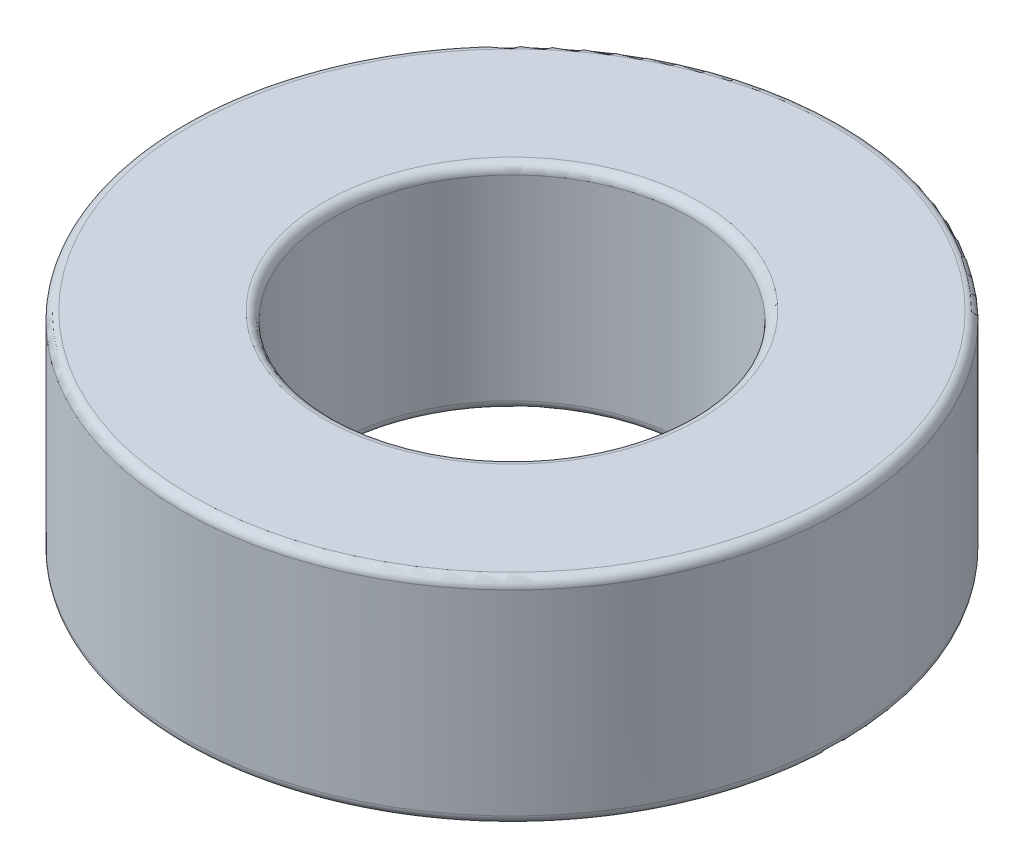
ISO-10303-21;
HEADER;
FILE_DESCRIPTION(('STEP AP214'),'2;1');
FILE_NAME('part.step','',(''),(''),'','','');
FILE_SCHEMA(('AUTOMOTIVE_DESIGN { 1 0 10303 214 1 1 1 1 }'));
ENDSEC;
DATA;
#1=APPLICATION_CONTEXT('core data for automotive mechanical design processes');
#2=APPLICATION_PROTOCOL_DEFINITION('international standard','automotive_design',2000,#1);
#3=PRODUCT_CONTEXT('',#1,'mechanical');
#4=PRODUCT('Part','Part','',(#3));
#5=PRODUCT_RELATED_PRODUCT_CATEGORY('part','',(#4));
#6=PRODUCT_DEFINITION_FORMATION('','',#4);
#7=PRODUCT_DEFINITION_CONTEXT('part definition',#1,'design');
#8=PRODUCT_DEFINITION('design','',#6,#7);
#9=PRODUCT_DEFINITION_SHAPE('','',#8);
#10=(LENGTH_UNIT() NAMED_UNIT(*) SI_UNIT(.MILLI.,.METRE.));
#11=(NAMED_UNIT(*) PLANE_ANGLE_UNIT() SI_UNIT($,.RADIAN.));
#12=(NAMED_UNIT(*) SI_UNIT($,.STERADIAN.) SOLID_ANGLE_UNIT());
#13=UNCERTAINTY_MEASURE_WITH_UNIT(LENGTH_MEASURE(1.E-05),#10,'distance_accuracy_value','');
#14=(GEOMETRIC_REPRESENTATION_CONTEXT(3) GLOBAL_UNCERTAINTY_ASSIGNED_CONTEXT((#13)) GLOBAL_UNIT_ASSIGNED_CONTEXT((#10,
#11,#12)) REPRESENTATION_CONTEXT('',''));
#15=CARTESIAN_POINT('',(0.,0.,0.));
#16=DIRECTION('',(0.,0.,1.));
#17=DIRECTION('',(1.,0.,0.));
#18=AXIS2_PLACEMENT_3D('',#15,#16,#17);
#19=CARTESIAN_POINT('',(0.,0.,-6.2103));
#20=DIRECTION('',(0.,-1.,0.));
#21=DIRECTION('',(0.,0.,-1.));
#22=AXIS2_PLACEMENT_3D('',#19,#20,#21);
#23=PLANE('',#22);
#24=CARTESIAN_POINT('',(0.,0.,0.));
#25=DIRECTION('',(0.,-1.,0.));
#26=DIRECTION('',(0.,0.,-1.));
#27=AXIS2_PLACEMENT_3D('',#24,#25,#26);
#28=CIRCLE('',#27,5.279);
#29=CARTESIAN_POINT('',(0.,0.,-5.279));
#30=VERTEX_POINT('',#29);
#31=EDGE_CURVE('E10',#30,#30,#28,.F.);
#32=ORIENTED_EDGE('',*,*,#31,.T.);
#33=EDGE_LOOP('',(#32));
#34=FACE_BOUND('',#33,.T.);
#35=CARTESIAN_POINT('',(0.,0.,0.));
#36=DIRECTION('',(0.,-1.,0.));
#37=DIRECTION('',(0.,0.,-1.));
#38=AXIS2_PLACEMENT_3D('',#35,#36,#37);
#39=CIRCLE('',#38,6.2103);
#40=CARTESIAN_POINT('',(0.,0.,-6.2103));
#41=VERTEX_POINT('',#40);
#42=EDGE_CURVE('E85',#41,#41,#39,.T.);
#43=ORIENTED_EDGE('',*,*,#42,.T.);
#44=EDGE_LOOP('',(#43));
#45=FACE_BOUND('',#44,.T.);
#46=ADVANCED_FACE('F43',(#34,#45),#23,.T.);
#47=CARTESIAN_POINT('',(0.,0.,0.));
#48=DIRECTION('',(0.,-1.,0.));
#49=DIRECTION('',(0.,0.,-1.));
#50=AXIS2_PLACEMENT_3D('',#47,#48,#49);
#51=CYLINDRICAL_SURFACE('',#50,6.2103);
#52=CARTESIAN_POINT('',(0.,1.016,0.));
#53=DIRECTION('',(0.,-1.,0.));
#54=DIRECTION('',(0.,0.,-1.));
#55=AXIS2_PLACEMENT_3D('',#52,#53,#54);
#56=CIRCLE('',#55,6.2103);
#57=CARTESIAN_POINT('',(0.,1.016,-6.2103));
#58=VERTEX_POINT('',#57);
#59=EDGE_CURVE('E88',#58,#58,#56,.T.);
#60=ORIENTED_EDGE('',*,*,#59,.T.);
#61=EDGE_LOOP('',(#60));
#62=FACE_BOUND('',#61,.T.);
#63=ORIENTED_EDGE('',*,*,#42,.F.);
#64=EDGE_LOOP('',(#63));
#65=FACE_BOUND('',#64,.T.);
#66=ADVANCED_FACE('F126',(#62,#65),#51,.T.);
#67=CARTESIAN_POINT('',(0.,1.016,0.));
#68=DIRECTION('',(0.,-1.,0.));
#69=DIRECTION('',(0.,0.,-1.));
#70=AXIS2_PLACEMENT_3D('',#67,#68,#69);
#71=TOROIDAL_SURFACE('',#70,6.4643,0.254);
#72=CARTESIAN_POINT('',(0.,1.27,0.));
#73=DIRECTION('',(0.,-1.,0.));
#74=DIRECTION('',(0.,0.,-1.));
#75=AXIS2_PLACEMENT_3D('',#72,#73,#74);
#76=CIRCLE('',#75,6.4643);
#77=CARTESIAN_POINT('',(0.,1.27,-6.4643));
#78=VERTEX_POINT('',#77);
#79=EDGE_CURVE('E92',#78,#78,#76,.T.);
#80=ORIENTED_EDGE('',*,*,#79,.T.);
#81=EDGE_LOOP('',(#80));
#82=FACE_BOUND('',#81,.T.);
#83=ORIENTED_EDGE('',*,*,#59,.F.);
#84=EDGE_LOOP('',(#83));
#85=FACE_BOUND('',#84,.T.);
#86=ADVANCED_FACE('F131',(#82,#85),#71,.F.);
#87=CARTESIAN_POINT('',(0.,1.27,-8.0899));
#88=DIRECTION('',(0.,-1.,0.));
#89=DIRECTION('',(0.,0.,-1.));
#90=AXIS2_PLACEMENT_3D('',#87,#88,#89);
#91=PLANE('',#90);
#92=CARTESIAN_POINT('',(0.,1.27,0.));
#93=DIRECTION('',(0.,-1.,0.));
#94=DIRECTION('',(0.,0.,-1.));
#95=AXIS2_PLACEMENT_3D('',#92,#93,#94);
#96=CIRCLE('',#95,8.0899);
#97=CARTESIAN_POINT('',(0.,1.27,-8.0899));
#98=VERTEX_POINT('',#97);
#99=EDGE_CURVE('E95',#98,#98,#96,.T.);
#100=ORIENTED_EDGE('',*,*,#99,.T.);
#101=EDGE_LOOP('',(#100));
#102=FACE_BOUND('',#101,.T.);
#103=ORIENTED_EDGE('',*,*,#79,.F.);
#104=EDGE_LOOP('',(#103));
#105=FACE_BOUND('',#104,.T.);
#106=ADVANCED_FACE('F239',(#102,#105),#91,.T.);
#107=CARTESIAN_POINT('',(0.,1.016,0.));
#108=DIRECTION('',(0.,-1.,0.));
#109=DIRECTION('',(0.,0.,-1.));
#110=AXIS2_PLACEMENT_3D('',#107,#108,#109);
#111=TOROIDAL_SURFACE('',#110,8.0899,0.253999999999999);
#112=CARTESIAN_POINT('',(0.,1.016,0.));
#113=DIRECTION('',(0.,-1.,0.));
#114=DIRECTION('',(0.,0.,-1.));
#115=AXIS2_PLACEMENT_3D('',#112,#113,#114);
#116=CIRCLE('',#115,8.3439);
#117=CARTESIAN_POINT('',(0.,1.016,-8.3439));
#118=VERTEX_POINT('',#117);
#119=EDGE_CURVE('E99',#118,#118,#116,.T.);
#120=ORIENTED_EDGE('',*,*,#119,.T.);
#121=EDGE_LOOP('',(#120));
#122=FACE_BOUND('',#121,.T.);
#123=ORIENTED_EDGE('',*,*,#99,.F.);
#124=EDGE_LOOP('',(#123));
#125=FACE_BOUND('',#124,.T.);
#126=ADVANCED_FACE('F123',(#122,#125),#111,.F.);
#127=CARTESIAN_POINT('',(0.,0.,0.));
#128=DIRECTION('',(0.,-1.,0.));
#129=DIRECTION('',(0.,0.,-1.));
#130=AXIS2_PLACEMENT_3D('',#127,#128,#129);
#131=CYLINDRICAL_SURFACE('',#130,8.3439);
#132=CARTESIAN_POINT('',(0.,0.,0.));
#133=DIRECTION('',(0.,-1.,0.));
#134=DIRECTION('',(0.,0.,-1.));
#135=AXIS2_PLACEMENT_3D('',#132,#133,#134);
#136=CIRCLE('',#135,8.3439);
#137=CARTESIAN_POINT('',(0.,0.,-8.3439));
#138=VERTEX_POINT('',#137);
#139=EDGE_CURVE('E103',#138,#138,#136,.T.);
#140=ORIENTED_EDGE('',*,*,#139,.T.);
#141=EDGE_LOOP('',(#140));
#142=FACE_BOUND('',#141,.T.);
#143=ORIENTED_EDGE('',*,*,#119,.F.);
#144=EDGE_LOOP('',(#143));
#145=FACE_BOUND('',#144,.T.);
#146=ADVANCED_FACE('F108',(#142,#145),#131,.F.);
#147=CARTESIAN_POINT('',(0.,0.,-9.25));
#148=DIRECTION('',(0.,-1.,0.));
#149=DIRECTION('',(0.,0.,-1.));
#150=AXIS2_PLACEMENT_3D('',#147,#148,#149);
#151=PLANE('',#150);
#152=CARTESIAN_POINT('',(0.,0.,0.));
#153=DIRECTION('',(0.,-1.,0.));
#154=DIRECTION('',(0.,0.,-1.));
#155=AXIS2_PLACEMENT_3D('',#152,#153,#154);
#156=CIRCLE('',#155,8.996);
#157=CARTESIAN_POINT('',(0.,0.,-8.996));
#158=VERTEX_POINT('',#157);
#159=EDGE_CURVE('E81',#158,#158,#156,.T.);
#160=ORIENTED_EDGE('',*,*,#159,.T.);
#161=EDGE_LOOP('',(#160));
#162=FACE_BOUND('',#161,.T.);
#163=ORIENTED_EDGE('',*,*,#139,.F.);
#164=EDGE_LOOP('',(#163));
#165=FACE_BOUND('',#164,.T.);
#166=ADVANCED_FACE('F111',(#162,#165),#151,.T.);
#167=CARTESIAN_POINT('',(0.,0.,0.));
#168=DIRECTION('',(0.,-1.,0.));
#169=DIRECTION('',(0.,0.,-1.));
#170=AXIS2_PLACEMENT_3D('',#167,#168,#169);
#171=CYLINDRICAL_SURFACE('',#170,9.25);
#172=CARTESIAN_POINT('',(0.,0.254000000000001,0.));
#173=DIRECTION('',(0.,-1.,0.));
#174=DIRECTION('',(0.,0.,-1.));
#175=AXIS2_PLACEMENT_3D('',#172,#173,#174);
#176=CIRCLE('',#175,9.25);
#177=CARTESIAN_POINT('',(0.,0.254000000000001,-9.25));
#178=VERTEX_POINT('',#177);
#179=EDGE_CURVE('E73',#178,#178,#176,.F.);
#180=ORIENTED_EDGE('',*,*,#179,.T.);
#181=EDGE_LOOP('',(#180));
#182=FACE_BOUND('',#181,.T.);
#183=CARTESIAN_POINT('',(0.,5.746,0.));
#184=DIRECTION('',(0.,1.,0.));
#185=DIRECTION('',(0.,0.,1.));
#186=AXIS2_PLACEMENT_3D('',#183,#184,#185);
#187=CIRCLE('',#186,9.25);
#188=CARTESIAN_POINT('',(0.,5.746,9.25));
#189=VERTEX_POINT('',#188);
#190=EDGE_CURVE('E77',#189,#189,#187,.F.);
#191=ORIENTED_EDGE('',*,*,#190,.T.);
#192=EDGE_LOOP('',(#191));
#193=FACE_BOUND('',#192,.T.);
#194=ADVANCED_FACE('F113',(#182,#193),#171,.T.);
#195=CARTESIAN_POINT('',(0.,6.,-5.025));
#196=DIRECTION('',(0.,1.,0.));
#197=DIRECTION('',(0.,0.,1.));
#198=AXIS2_PLACEMENT_3D('',#195,#196,#197);
#199=PLANE('',#198);
#200=CARTESIAN_POINT('',(0.,6.,0.));
#201=DIRECTION('',(0.,1.,0.));
#202=DIRECTION('',(0.,0.,1.));
#203=AXIS2_PLACEMENT_3D('',#200,#201,#202);
#204=CIRCLE('',#203,8.996);
#205=CARTESIAN_POINT('',(0.,6.,8.996));
#206=VERTEX_POINT('',#205);
#207=EDGE_CURVE('E64',#206,#206,#204,.T.);
#208=ORIENTED_EDGE('',*,*,#207,.T.);
#209=EDGE_LOOP('',(#208));
#210=FACE_BOUND('',#209,.T.);
#211=CARTESIAN_POINT('',(0.,6.,0.));
#212=DIRECTION('',(0.,1.,0.));
#213=DIRECTION('',(0.,0.,1.));
#214=AXIS2_PLACEMENT_3D('',#211,#212,#213);
#215=CIRCLE('',#214,5.279);
#216=CARTESIAN_POINT('',(0.,6.,5.279));
#217=VERTEX_POINT('',#216);
#218=EDGE_CURVE('E70',#217,#217,#215,.F.);
#219=ORIENTED_EDGE('',*,*,#218,.T.);
#220=EDGE_LOOP('',(#219));
#221=FACE_BOUND('',#220,.T.);
#222=ADVANCED_FACE('F120',(#210,#221),#199,.T.);
#223=CARTESIAN_POINT('',(0.,0.,0.));
#224=DIRECTION('',(0.,-1.,0.));
#225=DIRECTION('',(0.,0.,-1.));
#226=AXIS2_PLACEMENT_3D('',#223,#224,#225);
#227=CYLINDRICAL_SURFACE('',#226,5.025);
#228=CARTESIAN_POINT('',(0.,5.746,0.));
#229=DIRECTION('',(0.,1.,0.));
#230=DIRECTION('',(0.,0.,1.));
#231=AXIS2_PLACEMENT_3D('',#228,#229,#230);
#232=CIRCLE('',#231,5.025);
#233=CARTESIAN_POINT('',(0.,5.746,5.025));
#234=VERTEX_POINT('',#233);
#235=EDGE_CURVE('E51',#234,#234,#232,.T.);
#236=ORIENTED_EDGE('',*,*,#235,.T.);
#237=EDGE_LOOP('',(#236));
#238=FACE_BOUND('',#237,.T.);
#239=CARTESIAN_POINT('',(0.,0.254,0.));
#240=DIRECTION('',(0.,-1.,0.));
#241=DIRECTION('',(0.,0.,-1.));
#242=AXIS2_PLACEMENT_3D('',#239,#240,#241);
#243=CIRCLE('',#242,5.025);
#244=CARTESIAN_POINT('',(0.,0.254,-5.025));
#245=VERTEX_POINT('',#244);
#246=EDGE_CURVE('E58',#245,#245,#243,.T.);
#247=ORIENTED_EDGE('',*,*,#246,.T.);
#248=EDGE_LOOP('',(#247));
#249=FACE_BOUND('',#248,.T.);
#250=ADVANCED_FACE('F141',(#238,#249),#227,.F.);
#251=CARTESIAN_POINT('',(0.,0.254000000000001,0.));
#252=DIRECTION('',(0.,-1.,0.));
#253=DIRECTION('',(0.,0.,-1.));
#254=AXIS2_PLACEMENT_3D('',#251,#252,#253);
#255=TOROIDAL_SURFACE('',#254,8.996,0.254);
#256=ORIENTED_EDGE('',*,*,#179,.F.);
#257=EDGE_LOOP('',(#256));
#258=FACE_BOUND('',#257,.T.);
#259=ORIENTED_EDGE('',*,*,#159,.F.);
#260=EDGE_LOOP('',(#259));
#261=FACE_BOUND('',#260,.T.);
#262=ADVANCED_FACE('F137',(#258,#261),#255,.T.);
#263=CARTESIAN_POINT('',(0.,5.746,0.));
#264=DIRECTION('',(0.,1.,0.));
#265=DIRECTION('',(0.,0.,1.));
#266=AXIS2_PLACEMENT_3D('',#263,#264,#265);
#267=TOROIDAL_SURFACE('',#266,8.996,0.254);
#268=ORIENTED_EDGE('',*,*,#207,.F.);
#269=EDGE_LOOP('',(#268));
#270=FACE_BOUND('',#269,.T.);
#271=ORIENTED_EDGE('',*,*,#190,.F.);
#272=EDGE_LOOP('',(#271));
#273=FACE_BOUND('',#272,.T.);
#274=ADVANCED_FACE('F140',(#270,#273),#267,.T.);
#275=CARTESIAN_POINT('',(0.,5.746,0.));
#276=DIRECTION('',(0.,1.,0.));
#277=DIRECTION('',(0.,0.,1.));
#278=AXIS2_PLACEMENT_3D('',#275,#276,#277);
#279=TOROIDAL_SURFACE('',#278,5.279,0.254);
#280=ORIENTED_EDGE('',*,*,#235,.F.);
#281=EDGE_LOOP('',(#280));
#282=FACE_BOUND('',#281,.T.);
#283=ORIENTED_EDGE('',*,*,#218,.F.);
#284=EDGE_LOOP('',(#283));
#285=FACE_BOUND('',#284,.T.);
#286=ADVANCED_FACE('F144',(#282,#285),#279,.T.);
#287=CARTESIAN_POINT('',(0.,0.254,0.));
#288=DIRECTION('',(0.,-1.,0.));
#289=DIRECTION('',(0.,0.,-1.));
#290=AXIS2_PLACEMENT_3D('',#287,#288,#289);
#291=TOROIDAL_SURFACE('',#290,5.279,0.254);
#292=ORIENTED_EDGE('',*,*,#31,.F.);
#293=EDGE_LOOP('',(#292));
#294=FACE_BOUND('',#293,.T.);
#295=ORIENTED_EDGE('',*,*,#246,.F.);
#296=EDGE_LOOP('',(#295));
#297=FACE_BOUND('',#296,.T.);
#298=ADVANCED_FACE('F45',(#294,#297),#291,.T.);
#299=CLOSED_SHELL('',(#46,#66,#86,#106,#126,#146,#166,#194,#222,#250,#262,#274,#286,#298));
#300=MANIFOLD_SOLID_BREP('B2',#299);
#301=ADVANCED_BREP_SHAPE_REPRESENTATION('',(#18,#300),#14);
#302=SHAPE_DEFINITION_REPRESENTATION(#9,#301);
ENDSEC;
END-ISO-10303-21;
